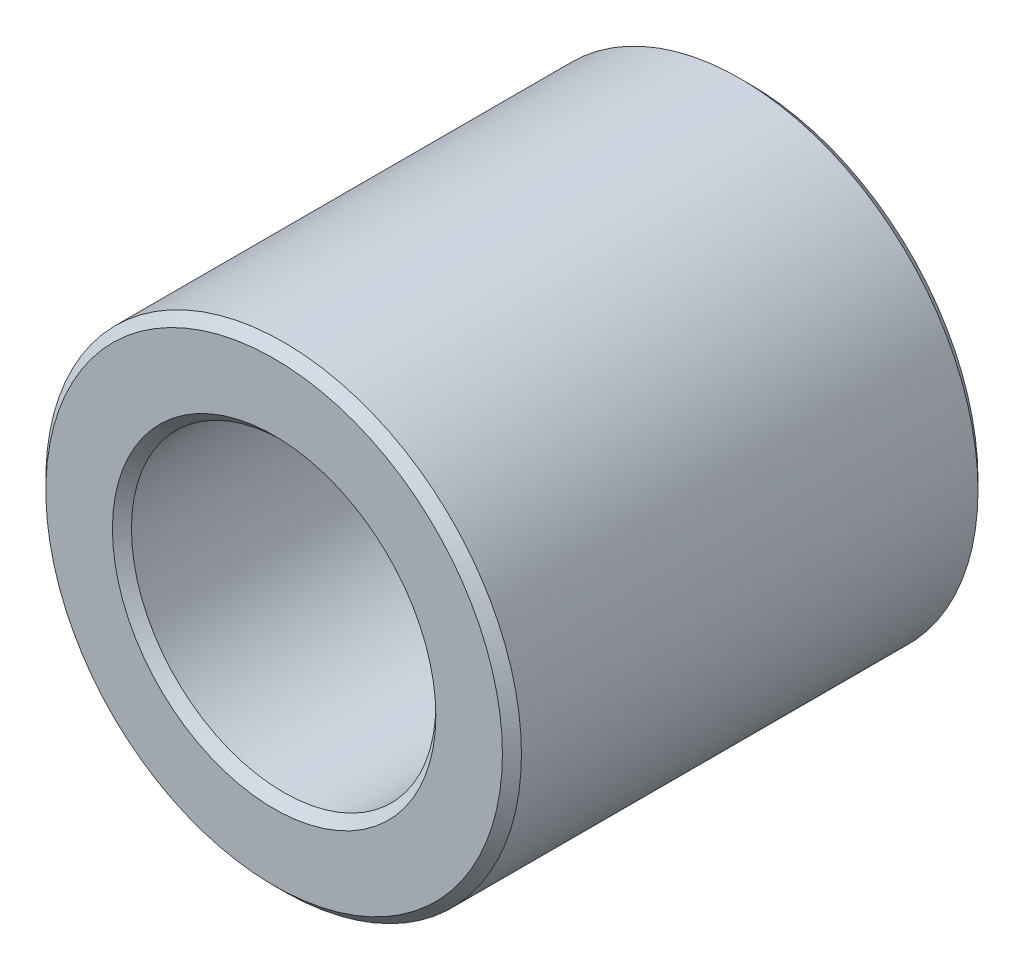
ISO-10303-21;
HEADER;
FILE_DESCRIPTION(('STEP AP214'),'2;1');
FILE_NAME('part.step','',(''),(''),'','','');
FILE_SCHEMA(('AUTOMOTIVE_DESIGN { 1 0 10303 214 1 1 1 1 }'));
ENDSEC;
DATA;
#1=APPLICATION_CONTEXT('core data for automotive mechanical design processes');
#2=APPLICATION_PROTOCOL_DEFINITION('international standard','automotive_design',2000,#1);
#3=PRODUCT_CONTEXT('',#1,'mechanical');
#4=PRODUCT('Part','Part','',(#3));
#5=PRODUCT_RELATED_PRODUCT_CATEGORY('part','',(#4));
#6=PRODUCT_DEFINITION_FORMATION('','',#4);
#7=PRODUCT_DEFINITION_CONTEXT('part definition',#1,'design');
#8=PRODUCT_DEFINITION('design','',#6,#7);
#9=PRODUCT_DEFINITION_SHAPE('','',#8);
#10=(LENGTH_UNIT() NAMED_UNIT(*) SI_UNIT(.MILLI.,.METRE.));
#11=(NAMED_UNIT(*) PLANE_ANGLE_UNIT() SI_UNIT($,.RADIAN.));
#12=(NAMED_UNIT(*) SI_UNIT($,.STERADIAN.) SOLID_ANGLE_UNIT());
#13=UNCERTAINTY_MEASURE_WITH_UNIT(LENGTH_MEASURE(1.E-05),#10,'distance_accuracy_value','');
#14=(GEOMETRIC_REPRESENTATION_CONTEXT(3) GLOBAL_UNCERTAINTY_ASSIGNED_CONTEXT((#13)) GLOBAL_UNIT_ASSIGNED_CONTEXT((#10,
#11,#12)) REPRESENTATION_CONTEXT('',''));
#15=CARTESIAN_POINT('',(0.,0.,0.));
#16=DIRECTION('',(0.,0.,1.));
#17=DIRECTION('',(1.,0.,0.));
#18=AXIS2_PLACEMENT_3D('',#15,#16,#17);
#19=CARTESIAN_POINT('',(0.,0.,5.));
#20=DIRECTION('',(0.,0.,1.));
#21=DIRECTION('',(1.,0.,0.));
#22=AXIS2_PLACEMENT_3D('',#19,#20,#21);
#23=PLANE('',#22);
#24=CARTESIAN_POINT('',(0.,0.,5.));
#25=DIRECTION('',(0.,0.,1.));
#26=DIRECTION('',(1.,0.,0.));
#27=AXIS2_PLACEMENT_3D('',#24,#25,#26);
#28=CIRCLE('',#27,3.40000000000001);
#29=CARTESIAN_POINT('',(3.40000000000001,0.,5.));
#30=VERTEX_POINT('',#29);
#31=EDGE_CURVE('E10',#30,#30,#28,.F.);
#32=ORIENTED_EDGE('',*,*,#31,.T.);
#33=EDGE_LOOP('',(#32));
#34=FACE_BOUND('',#33,.T.);
#35=CARTESIAN_POINT('',(0.,0.,5.));
#36=DIRECTION('',(0.,0.,1.));
#37=DIRECTION('',(1.,0.,0.));
#38=AXIS2_PLACEMENT_3D('',#35,#36,#37);
#39=CIRCLE('',#38,4.8);
#40=CARTESIAN_POINT('',(4.8,0.,5.));
#41=VERTEX_POINT('',#40);
#42=EDGE_CURVE('E45',#41,#41,#39,.T.);
#43=ORIENTED_EDGE('',*,*,#42,.T.);
#44=EDGE_LOOP('',(#43));
#45=FACE_BOUND('',#44,.T.);
#46=ADVANCED_FACE('F37',(#34,#45),#23,.T.);
#47=CARTESIAN_POINT('',(0.,0.,-5.));
#48=DIRECTION('',(0.,0.,1.));
#49=DIRECTION('',(1.,0.,0.));
#50=AXIS2_PLACEMENT_3D('',#47,#48,#49);
#51=PLANE('',#50);
#52=CARTESIAN_POINT('',(0.,0.,-5.));
#53=DIRECTION('',(0.,0.,1.));
#54=DIRECTION('',(1.,0.,0.));
#55=AXIS2_PLACEMENT_3D('',#52,#53,#54);
#56=CIRCLE('',#55,4.8);
#57=CARTESIAN_POINT('',(4.8,0.,-5.));
#58=VERTEX_POINT('',#57);
#59=EDGE_CURVE('E62',#58,#58,#56,.F.);
#60=ORIENTED_EDGE('',*,*,#59,.T.);
#61=EDGE_LOOP('',(#60));
#62=FACE_BOUND('',#61,.T.);
#63=CARTESIAN_POINT('',(0.,0.,-5.));
#64=DIRECTION('',(0.,0.,1.));
#65=DIRECTION('',(1.,0.,0.));
#66=AXIS2_PLACEMENT_3D('',#63,#64,#65);
#67=CIRCLE('',#66,3.4);
#68=CARTESIAN_POINT('',(3.4,0.,-5.));
#69=VERTEX_POINT('',#68);
#70=EDGE_CURVE('E66',#69,#69,#67,.T.);
#71=ORIENTED_EDGE('',*,*,#70,.T.);
#72=EDGE_LOOP('',(#71));
#73=FACE_BOUND('',#72,.T.);
#74=ADVANCED_FACE('F89',(#62,#73),#51,.F.);
#75=CARTESIAN_POINT('',(0.,0.,5.));
#76=DIRECTION('',(0.,0.,-1.));
#77=DIRECTION('',(-1.,0.,0.));
#78=AXIS2_PLACEMENT_3D('',#75,#76,#77);
#79=CYLINDRICAL_SURFACE('',#78,5.);
#80=CARTESIAN_POINT('',(0.,0.,-4.8));
#81=DIRECTION('',(0.,0.,1.));
#82=DIRECTION('',(1.,0.,0.));
#83=AXIS2_PLACEMENT_3D('',#80,#81,#82);
#84=CIRCLE('',#83,5.);
#85=CARTESIAN_POINT('',(5.,0.,-4.8));
#86=VERTEX_POINT('',#85);
#87=EDGE_CURVE('E70',#86,#86,#84,.T.);
#88=ORIENTED_EDGE('',*,*,#87,.T.);
#89=EDGE_LOOP('',(#88));
#90=FACE_BOUND('',#89,.T.);
#91=CARTESIAN_POINT('',(0.,0.,4.8));
#92=DIRECTION('',(0.,0.,1.));
#93=DIRECTION('',(1.,0.,0.));
#94=AXIS2_PLACEMENT_3D('',#91,#92,#93);
#95=CIRCLE('',#94,5.);
#96=CARTESIAN_POINT('',(5.,0.,4.8));
#97=VERTEX_POINT('',#96);
#98=EDGE_CURVE('E73',#97,#97,#95,.F.);
#99=ORIENTED_EDGE('',*,*,#98,.T.);
#100=EDGE_LOOP('',(#99));
#101=FACE_BOUND('',#100,.T.);
#102=ADVANCED_FACE('F78',(#90,#101),#79,.T.);
#103=CARTESIAN_POINT('',(0.,0.,5.));
#104=DIRECTION('',(0.,0.,-1.));
#105=DIRECTION('',(-1.,0.,0.));
#106=AXIS2_PLACEMENT_3D('',#103,#104,#105);
#107=CYLINDRICAL_SURFACE('',#106,3.2);
#108=CARTESIAN_POINT('',(0.,0.,-4.8));
#109=DIRECTION('',(0.,0.,1.));
#110=DIRECTION('',(1.,0.,0.));
#111=AXIS2_PLACEMENT_3D('',#108,#109,#110);
#112=CIRCLE('',#111,3.2);
#113=CARTESIAN_POINT('',(3.2,0.,-4.8));
#114=VERTEX_POINT('',#113);
#115=EDGE_CURVE('E51',#114,#114,#112,.F.);
#116=ORIENTED_EDGE('',*,*,#115,.T.);
#117=EDGE_LOOP('',(#116));
#118=FACE_BOUND('',#117,.T.);
#119=CARTESIAN_POINT('',(0.,0.,4.8));
#120=DIRECTION('',(0.,0.,1.));
#121=DIRECTION('',(1.,0.,0.));
#122=AXIS2_PLACEMENT_3D('',#119,#120,#121);
#123=CIRCLE('',#122,3.2);
#124=CARTESIAN_POINT('',(3.2,0.,4.8));
#125=VERTEX_POINT('',#124);
#126=EDGE_CURVE('E57',#125,#125,#123,.T.);
#127=ORIENTED_EDGE('',*,*,#126,.T.);
#128=EDGE_LOOP('',(#127));
#129=FACE_BOUND('',#128,.T.);
#130=ADVANCED_FACE('F97',(#118,#129),#107,.F.);
#131=CARTESIAN_POINT('',(0.,0.,-4.8));
#132=DIRECTION('',(0.,0.,1.));
#133=DIRECTION('',(1.,0.,0.));
#134=AXIS2_PLACEMENT_3D('',#131,#132,#133);
#135=CONICAL_SURFACE('',#134,5.,0.785398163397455);
#136=ORIENTED_EDGE('',*,*,#59,.F.);
#137=EDGE_LOOP('',(#136));
#138=FACE_BOUND('',#137,.T.);
#139=ORIENTED_EDGE('',*,*,#87,.F.);
#140=EDGE_LOOP('',(#139));
#141=FACE_BOUND('',#140,.T.);
#142=ADVANCED_FACE('F102',(#138,#141),#135,.T.);
#143=CARTESIAN_POINT('',(0.,0.,-5.));
#144=DIRECTION('',(0.,0.,-1.));
#145=DIRECTION('',(-1.,0.,0.));
#146=AXIS2_PLACEMENT_3D('',#143,#144,#145);
#147=CONICAL_SURFACE('',#146,3.4,0.785398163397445);
#148=ORIENTED_EDGE('',*,*,#115,.F.);
#149=EDGE_LOOP('',(#148));
#150=FACE_BOUND('',#149,.T.);
#151=ORIENTED_EDGE('',*,*,#70,.F.);
#152=EDGE_LOOP('',(#151));
#153=FACE_BOUND('',#152,.T.);
#154=ADVANCED_FACE('F86',(#150,#153),#147,.F.);
#155=CARTESIAN_POINT('',(0.,0.,4.8));
#156=DIRECTION('',(0.,0.,1.));
#157=DIRECTION('',(1.,0.,0.));
#158=AXIS2_PLACEMENT_3D('',#155,#156,#157);
#159=CONICAL_SURFACE('',#158,3.2,0.785398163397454);
#160=ORIENTED_EDGE('',*,*,#31,.F.);
#161=EDGE_LOOP('',(#160));
#162=FACE_BOUND('',#161,.T.);
#163=ORIENTED_EDGE('',*,*,#126,.F.);
#164=EDGE_LOOP('',(#163));
#165=FACE_BOUND('',#164,.T.);
#166=ADVANCED_FACE('F82',(#162,#165),#159,.F.);
#167=CARTESIAN_POINT('',(0.,0.,5.));
#168=DIRECTION('',(0.,0.,-1.));
#169=DIRECTION('',(-1.,0.,0.));
#170=AXIS2_PLACEMENT_3D('',#167,#168,#169);
#171=CONICAL_SURFACE('',#170,4.8,0.785398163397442);
#172=ORIENTED_EDGE('',*,*,#98,.F.);
#173=EDGE_LOOP('',(#172));
#174=FACE_BOUND('',#173,.T.);
#175=ORIENTED_EDGE('',*,*,#42,.F.);
#176=EDGE_LOOP('',(#175));
#177=FACE_BOUND('',#176,.T.);
#178=ADVANCED_FACE('F39',(#174,#177),#171,.T.);
#179=CLOSED_SHELL('',(#46,#74,#102,#130,#142,#154,#166,#178));
#180=MANIFOLD_SOLID_BREP('B2',#179);
#181=ADVANCED_BREP_SHAPE_REPRESENTATION('',(#18,#180),#14);
#182=SHAPE_DEFINITION_REPRESENTATION(#9,#181);
ENDSEC;
END-ISO-10303-21;
